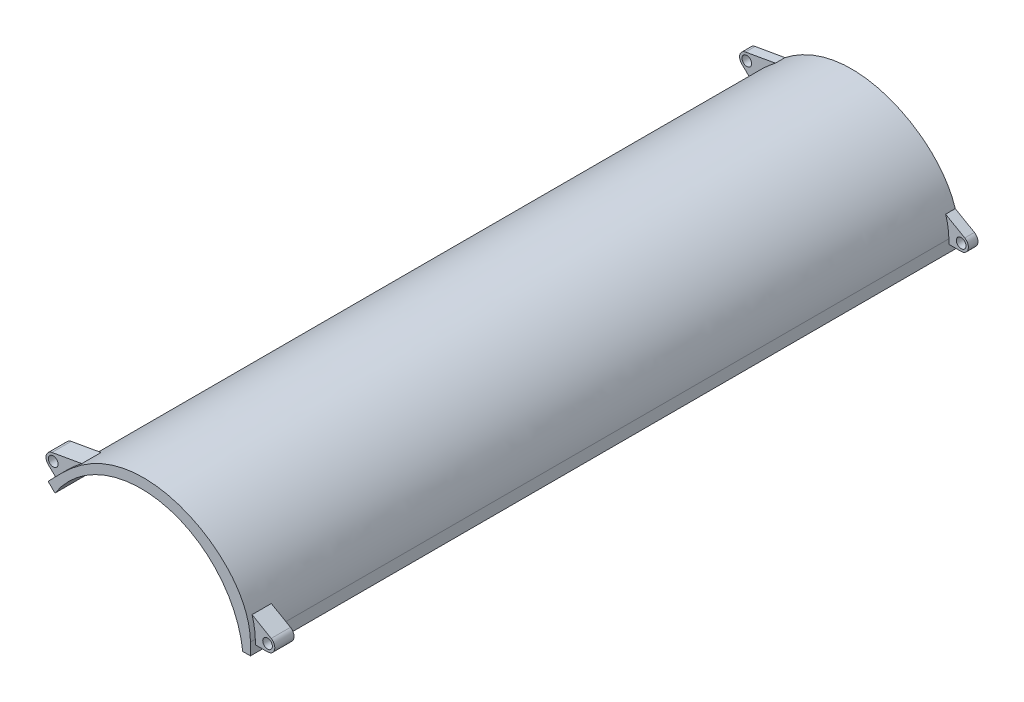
ISO-10303-21;
HEADER;
FILE_DESCRIPTION(('STEP AP214'),'2;1');
FILE_NAME('part.step','',(''),(''),'','','');
FILE_SCHEMA(('AUTOMOTIVE_DESIGN { 1 0 10303 214 1 1 1 1 }'));
ENDSEC;
DATA;
#1=APPLICATION_CONTEXT('core data for automotive mechanical design processes');
#2=APPLICATION_PROTOCOL_DEFINITION('international standard','automotive_design',2000,#1);
#3=PRODUCT_CONTEXT('',#1,'mechanical');
#4=PRODUCT('Part','Part','',(#3));
#5=PRODUCT_RELATED_PRODUCT_CATEGORY('part','',(#4));
#6=PRODUCT_DEFINITION_FORMATION('','',#4);
#7=PRODUCT_DEFINITION_CONTEXT('part definition',#1,'design');
#8=PRODUCT_DEFINITION('design','',#6,#7);
#9=PRODUCT_DEFINITION_SHAPE('','',#8);
#10=(LENGTH_UNIT() NAMED_UNIT(*) SI_UNIT(.MILLI.,.METRE.));
#11=(NAMED_UNIT(*) PLANE_ANGLE_UNIT() SI_UNIT($,.RADIAN.));
#12=(NAMED_UNIT(*) SI_UNIT($,.STERADIAN.) SOLID_ANGLE_UNIT());
#13=UNCERTAINTY_MEASURE_WITH_UNIT(LENGTH_MEASURE(1.E-05),#10,'distance_accuracy_value','');
#14=(GEOMETRIC_REPRESENTATION_CONTEXT(3) GLOBAL_UNCERTAINTY_ASSIGNED_CONTEXT((#13)) GLOBAL_UNIT_ASSIGNED_CONTEXT((#10,
#11,#12)) REPRESENTATION_CONTEXT('',''));
#15=CARTESIAN_POINT('',(0.,0.,0.));
#16=DIRECTION('',(0.,0.,1.));
#17=DIRECTION('',(1.,0.,0.));
#18=AXIS2_PLACEMENT_3D('',#15,#16,#17);
#19=CARTESIAN_POINT('',(479.524287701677,50.,735.));
#20=CARTESIAN_POINT('',(477.15378099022,170.567422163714,735.));
#21=CARTESIAN_POINT('',(359.356081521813,236.563554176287,735.));
#22=CARTESIAN_POINT('',(287.408844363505,253.328836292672,735.));
#23=CARTESIAN_POINT('',(219.133886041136,251.435560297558,735.));
#24=CARTESIAN_POINT('',(152.416815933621,225.58654086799,735.));
#25=CARTESIAN_POINT('',(108.187547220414,179.583185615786,735.));
#26=CARTESIAN_POINT('',(69.7200278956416,139.572690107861,735.));
#27=B_SPLINE_CURVE_WITH_KNOTS('',7,(#19,#20,#21,#22,#23,#24,#25,#26),.UNSPECIFIED.,.F.,.F.,(8,
8),(0.,1.),.UNSPECIFIED.);
#28=DIRECTION('',(0.,0.,-1.));
#29=VECTOR('',#28,1.);
#30=SURFACE_OF_LINEAR_EXTRUSION('',#27,#29);
#31=CARTESIAN_POINT('',(69.7200278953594,139.572690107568,685.));
#32=CARTESIAN_POINT('',(76.0741492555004,146.181682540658,685.));
#33=CARTESIAN_POINT('',(82.5854794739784,152.954189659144,685.));
#34=CARTESIAN_POINT('',(89.3294022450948,159.772367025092,685.));
#35=CARTESIAN_POINT('',(96.3532676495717,166.535005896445,685.));
#36=CARTESIAN_POINT('',(103.683856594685,173.1559041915,685.));
#37=CARTESIAN_POINT('',(111.333957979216,179.561593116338,685.));
#38=CARTESIAN_POINT('',(119.307330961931,185.688881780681,685.));
#39=B_SPLINE_CURVE_WITH_KNOTS('',7,(#31,#32,#33,#34,#35,#36,#37,#38),.UNSPECIFIED.,.F.,.F.,(8,
8),(0.,0.165181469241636),.UNSPECIFIED.);
#40=CARTESIAN_POINT('',(69.7200278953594,139.572690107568,685.));
#41=VERTEX_POINT('',#40);
#42=CARTESIAN_POINT('',(119.307330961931,185.688881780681,685.));
#43=VERTEX_POINT('',#42);
#44=EDGE_CURVE('E224',#41,#43,#39,.T.);
#45=ORIENTED_EDGE('',*,*,#44,.T.);
#46=DIRECTION('',(0.,0.,1.));
#47=VECTOR('',#46,1.);
#48=CARTESIAN_POINT('',(119.307330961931,185.688881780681,685.));
#49=LINE('',#48,#47);
#50=CARTESIAN_POINT('',(119.307330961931,185.688881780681,725.));
#51=VERTEX_POINT('',#50);
#52=EDGE_CURVE('E207',#43,#51,#49,.T.);
#53=ORIENTED_EDGE('',*,*,#52,.T.);
#54=CARTESIAN_POINT('',(69.7200278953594,139.572690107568,725.));
#55=CARTESIAN_POINT('',(76.0741492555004,146.181682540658,725.));
#56=CARTESIAN_POINT('',(82.5854794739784,152.954189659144,725.));
#57=CARTESIAN_POINT('',(89.3294022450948,159.772367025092,725.));
#58=CARTESIAN_POINT('',(96.3532676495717,166.535005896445,725.));
#59=CARTESIAN_POINT('',(103.683856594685,173.1559041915,725.));
#60=CARTESIAN_POINT('',(111.333957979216,179.561593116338,725.));
#61=CARTESIAN_POINT('',(119.307330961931,185.688881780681,725.));
#62=B_SPLINE_CURVE_WITH_KNOTS('',7,(#54,#55,#56,#57,#58,#59,#60,#61),.UNSPECIFIED.,.F.,.F.,(8,
8),(0.,0.165181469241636),.UNSPECIFIED.);
#63=CARTESIAN_POINT('',(69.7200278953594,139.572690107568,725.));
#64=VERTEX_POINT('',#63);
#65=EDGE_CURVE('E248',#64,#51,#62,.T.);
#66=ORIENTED_EDGE('',*,*,#65,.F.);
#67=DIRECTION('',(0.,0.,-1.));
#68=VECTOR('',#67,1.);
#69=CARTESIAN_POINT('',(69.7200278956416,139.572690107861,735.));
#70=LINE('',#69,#68);
#71=CARTESIAN_POINT('',(69.7200278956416,139.572690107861,735.));
#72=VERTEX_POINT('',#71);
#73=EDGE_CURVE('E461',#72,#64,#70,.T.);
#74=ORIENTED_EDGE('',*,*,#73,.F.);
#75=CARTESIAN_POINT('',(479.524287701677,50.,735.));
#76=VERTEX_POINT('',#75);
#77=EDGE_CURVE('E388',#76,#72,#27,.T.);
#78=ORIENTED_EDGE('',*,*,#77,.F.);
#79=DIRECTION('',(0.,0.,-1.));
#80=VECTOR('',#79,1.);
#81=CARTESIAN_POINT('',(479.524287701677,50.,735.));
#82=LINE('',#81,#80);
#83=CARTESIAN_POINT('',(479.524287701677,50.0000000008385,725.));
#84=VERTEX_POINT('',#83);
#85=EDGE_CURVE('E430',#76,#84,#82,.T.);
#86=ORIENTED_EDGE('',*,*,#85,.T.);
#87=CARTESIAN_POINT('',(472.826933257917,90.8956368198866,725.));
#88=CARTESIAN_POINT('',(474.517057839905,85.4877859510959,725.));
#89=CARTESIAN_POINT('',(475.993797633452,79.9371958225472,725.));
#90=CARTESIAN_POINT('',(477.239796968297,74.2424995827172,725.));
#91=CARTESIAN_POINT('',(478.236465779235,68.4024521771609,725.));
#92=CARTESIAN_POINT('',(478.963896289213,62.4159497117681,725.));
#93=CARTESIAN_POINT('',(479.40077470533,56.2820507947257,725.));
#94=CARTESIAN_POINT('',(479.524287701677,50.0000000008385,725.));
#95=B_SPLINE_CURVE_WITH_KNOTS('',7,(#87,#88,#89,#90,#91,#92,#93,#94),.UNSPECIFIED.,.F.,.F.,(8,
8),(0.94789595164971,1.),.UNSPECIFIED.);
#96=CARTESIAN_POINT('',(472.82693326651,90.8956367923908,725.));
#97=VERTEX_POINT('',#96);
#98=EDGE_CURVE('E269',#97,#84,#95,.T.);
#99=ORIENTED_EDGE('',*,*,#98,.F.);
#100=DIRECTION('',(0.,0.,1.));
#101=VECTOR('',#100,1.);
#102=CARTESIAN_POINT('',(472.826933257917,90.8956368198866,685.));
#103=LINE('',#102,#101);
#104=CARTESIAN_POINT('',(472.826933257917,90.8956368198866,685.));
#105=VERTEX_POINT('',#104);
#106=EDGE_CURVE('E308',#105,#97,#103,.T.);
#107=ORIENTED_EDGE('',*,*,#106,.F.);
#108=CARTESIAN_POINT('',(472.826933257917,90.8956368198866,685.));
#109=CARTESIAN_POINT('',(474.517057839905,85.4877859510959,685.));
#110=CARTESIAN_POINT('',(475.993797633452,79.9371958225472,685.));
#111=CARTESIAN_POINT('',(477.239796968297,74.2424995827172,685.));
#112=CARTESIAN_POINT('',(478.236465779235,68.4024521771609,685.));
#113=CARTESIAN_POINT('',(478.963896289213,62.4159497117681,685.));
#114=CARTESIAN_POINT('',(479.40077470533,56.2820507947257,685.));
#115=CARTESIAN_POINT('',(479.524287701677,50.0000000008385,685.));
#116=B_SPLINE_CURVE_WITH_KNOTS('',7,(#108,#109,#110,#111,#112,#113,#114,#115),.UNSPECIFIED.,.F.,
.F.,(8,8),(0.94789595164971,1.),.UNSPECIFIED.);
#117=CARTESIAN_POINT('',(479.524287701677,50.0000000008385,685.));
#118=VERTEX_POINT('',#117);
#119=EDGE_CURVE('E272',#105,#118,#116,.T.);
#120=ORIENTED_EDGE('',*,*,#119,.T.);
#121=CARTESIAN_POINT('',(479.524287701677,50.,-715.));
#122=VERTEX_POINT('',#121);
#123=EDGE_CURVE('E454',#118,#122,#82,.T.);
#124=ORIENTED_EDGE('',*,*,#123,.T.);
#125=CARTESIAN_POINT('',(472.826933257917,90.8956368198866,-715.));
#126=CARTESIAN_POINT('',(474.517057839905,85.4877859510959,-715.));
#127=CARTESIAN_POINT('',(475.993797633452,79.9371958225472,-715.));
#128=CARTESIAN_POINT('',(477.239796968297,74.2424995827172,-715.));
#129=CARTESIAN_POINT('',(478.236465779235,68.4024521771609,-715.));
#130=CARTESIAN_POINT('',(478.963896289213,62.4159497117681,-715.));
#131=CARTESIAN_POINT('',(479.40077470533,56.2820507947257,-715.));
#132=CARTESIAN_POINT('',(479.524287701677,50.0000000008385,-715.));
#133=B_SPLINE_CURVE_WITH_KNOTS('',7,(#125,#126,#127,#128,#129,#130,#131,#132),.UNSPECIFIED.,.F.,
.F.,(8,8),(0.,1.),.UNSPECIFIED.);
#134=CARTESIAN_POINT('',(472.82693326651,90.8956367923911,-715.));
#135=VERTEX_POINT('',#134);
#136=EDGE_CURVE('E487',#135,#122,#133,.T.);
#137=ORIENTED_EDGE('',*,*,#136,.F.);
#138=DIRECTION('',(0.,0.,-1.));
#139=VECTOR('',#138,1.);
#140=CARTESIAN_POINT('',(472.826933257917,90.8956368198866,-715.));
#141=LINE('',#140,#139);
#142=CARTESIAN_POINT('',(472.826933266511,90.8956367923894,-735.));
#143=VERTEX_POINT('',#142);
#144=EDGE_CURVE('E365',#135,#143,#141,.T.);
#145=ORIENTED_EDGE('',*,*,#144,.T.);
#146=CARTESIAN_POINT('',(479.524287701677,50.,-735.));
#147=CARTESIAN_POINT('',(477.15378099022,170.567422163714,-735.));
#148=CARTESIAN_POINT('',(359.356081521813,236.563554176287,-735.));
#149=CARTESIAN_POINT('',(287.408844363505,253.328836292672,-735.));
#150=CARTESIAN_POINT('',(219.133886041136,251.435560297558,-735.));
#151=CARTESIAN_POINT('',(152.416815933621,225.58654086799,-735.));
#152=CARTESIAN_POINT('',(108.187547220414,179.583185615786,-735.));
#153=CARTESIAN_POINT('',(69.7200278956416,139.572690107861,-735.));
#154=B_SPLINE_CURVE_WITH_KNOTS('',7,(#146,#147,#148,#149,#150,#151,#152,#153),.UNSPECIFIED.,.F.,
.F.,(8,8),(0.,1.),.UNSPECIFIED.);
#155=CARTESIAN_POINT('',(119.307330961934,185.688881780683,-735.));
#156=VERTEX_POINT('',#155);
#157=EDGE_CURVE('E436',#143,#156,#154,.T.);
#158=ORIENTED_EDGE('',*,*,#157,.T.);
#159=DIRECTION('',(0.,0.,-1.));
#160=VECTOR('',#159,1.);
#161=CARTESIAN_POINT('',(119.307330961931,185.688881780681,-715.));
#162=LINE('',#161,#160);
#163=CARTESIAN_POINT('',(119.307330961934,185.688881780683,-715.));
#164=VERTEX_POINT('',#163);
#165=EDGE_CURVE('E310',#164,#156,#162,.T.);
#166=ORIENTED_EDGE('',*,*,#165,.F.);
#167=CARTESIAN_POINT('',(69.7200278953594,139.572690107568,-715.));
#168=CARTESIAN_POINT('',(76.0741492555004,146.181682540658,-715.));
#169=CARTESIAN_POINT('',(82.5854794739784,152.954189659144,-715.));
#170=CARTESIAN_POINT('',(89.3294022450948,159.772367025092,-715.));
#171=CARTESIAN_POINT('',(96.3532676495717,166.535005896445,-715.));
#172=CARTESIAN_POINT('',(103.683856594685,173.1559041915,-715.));
#173=CARTESIAN_POINT('',(111.333957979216,179.561593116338,-715.));
#174=CARTESIAN_POINT('',(119.307330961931,185.688881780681,-715.));
#175=B_SPLINE_CURVE_WITH_KNOTS('',7,(#167,#168,#169,#170,#171,#172,#173,#174),.UNSPECIFIED.,.F.,
.F.,(8,8),(0.,1.),.UNSPECIFIED.);
#176=CARTESIAN_POINT('',(69.7200278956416,139.572690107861,-715.));
#177=VERTEX_POINT('',#176);
#178=EDGE_CURVE('E320',#177,#164,#175,.T.);
#179=ORIENTED_EDGE('',*,*,#178,.F.);
#180=EDGE_CURVE('E45',#41,#177,#70,.T.);
#181=ORIENTED_EDGE('',*,*,#180,.F.);
#182=EDGE_LOOP('',(#45,#53,#66,#74,#78,#86,#99,#107,#120,#124,#137,#145,#158,#166,#179,#181));
#183=FACE_BOUND('',#182,.T.);
#184=ADVANCED_FACE('F41',(#183),#30,.F.);
#185=CARTESIAN_POINT('',(59.3239744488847,128.759639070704,735.));
#186=DIRECTION('',(0.720870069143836,-0.693070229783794,0.));
#187=DIRECTION('',(0.693070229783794,0.720870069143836,0.));
#188=AXIS2_PLACEMENT_3D('',#185,#186,#187);
#189=PLANE('',#188);
#190=DIRECTION('',(0.693070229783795,0.720870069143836,0.));
#191=VECTOR('',#190,1.);
#192=CARTESIAN_POINT('',(64.8607561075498,134.51850737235,685.));
#193=LINE('',#192,#191);
#194=CARTESIAN_POINT('',(64.8607561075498,134.51850737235,685.));
#195=VERTEX_POINT('',#194);
#196=EDGE_CURVE('E218',#195,#41,#193,.T.);
#197=ORIENTED_EDGE('',*,*,#196,.T.);
#198=ORIENTED_EDGE('',*,*,#180,.T.);
#199=DIRECTION('',(-0.693070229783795,-0.720870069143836,0.));
#200=VECTOR('',#199,1.);
#201=CARTESIAN_POINT('',(87.7853071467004,158.362588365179,-715.));
#202=LINE('',#201,#200);
#203=CARTESIAN_POINT('',(64.8607561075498,134.51850737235,-715.));
#204=VERTEX_POINT('',#203);
#205=EDGE_CURVE('E342',#177,#204,#202,.T.);
#206=ORIENTED_EDGE('',*,*,#205,.T.);
#207=DIRECTION('',(0.,0.,-1.));
#208=VECTOR('',#207,1.);
#209=CARTESIAN_POINT('',(64.8607561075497,134.51850737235,-715.));
#210=LINE('',#209,#208);
#211=CARTESIAN_POINT('',(64.8607561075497,134.51850737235,-735.));
#212=VERTEX_POINT('',#211);
#213=EDGE_CURVE('E317',#204,#212,#210,.T.);
#214=ORIENTED_EDGE('',*,*,#213,.T.);
#215=DIRECTION('',(-0.693070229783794,-0.720870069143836,0.));
#216=VECTOR('',#215,1.);
#217=CARTESIAN_POINT('',(59.3239744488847,128.759639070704,-735.));
#218=LINE('',#217,#216);
#219=CARTESIAN_POINT('',(59.3239744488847,128.759639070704,-735.));
#220=VERTEX_POINT('',#219);
#221=EDGE_CURVE('E438',#212,#220,#218,.T.);
#222=ORIENTED_EDGE('',*,*,#221,.T.);
#223=DIRECTION('',(0.,0.,-1.));
#224=VECTOR('',#223,1.);
#225=CARTESIAN_POINT('',(59.3239744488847,128.759639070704,735.));
#226=LINE('',#225,#224);
#227=CARTESIAN_POINT('',(59.3239744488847,128.759639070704,735.));
#228=VERTEX_POINT('',#227);
#229=EDGE_CURVE('E540',#228,#220,#226,.T.);
#230=ORIENTED_EDGE('',*,*,#229,.F.);
#231=DIRECTION('',(-0.693070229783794,-0.720870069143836,0.));
#232=VECTOR('',#231,1.);
#233=CARTESIAN_POINT('',(59.3239744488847,128.759639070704,735.));
#234=LINE('',#233,#232);
#235=EDGE_CURVE('E393',#72,#228,#234,.T.);
#236=ORIENTED_EDGE('',*,*,#235,.F.);
#237=ORIENTED_EDGE('',*,*,#73,.T.);
#238=DIRECTION('',(0.693070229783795,0.720870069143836,0.));
#239=VECTOR('',#238,1.);
#240=CARTESIAN_POINT('',(64.8607561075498,134.51850737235,725.));
#241=LINE('',#240,#239);
#242=CARTESIAN_POINT('',(64.8607561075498,134.51850737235,725.));
#243=VERTEX_POINT('',#242);
#244=EDGE_CURVE('E232',#243,#64,#241,.T.);
#245=ORIENTED_EDGE('',*,*,#244,.F.);
#246=DIRECTION('',(0.,0.,1.));
#247=VECTOR('',#246,1.);
#248=CARTESIAN_POINT('',(64.8607561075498,134.51850737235,685.));
#249=LINE('',#248,#247);
#250=EDGE_CURVE('E260',#195,#243,#249,.T.);
#251=ORIENTED_EDGE('',*,*,#250,.F.);
#252=EDGE_LOOP('',(#197,#198,#206,#214,#222,#230,#236,#237,#245,#251));
#253=FACE_BOUND('',#252,.T.);
#254=ADVANCED_FACE('F402',(#253),#189,.F.);
#255=CARTESIAN_POINT('',(479.524287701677,25.,735.));
#256=DIRECTION('',(-1.,0.,0.));
#257=DIRECTION('',(0.,-1.,0.));
#258=AXIS2_PLACEMENT_3D('',#255,#256,#257);
#259=PLANE('',#258);
#260=DIRECTION('',(0.,-1.,0.));
#261=VECTOR('',#260,1.);
#262=CARTESIAN_POINT('',(479.524287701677,50.0000000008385,685.));
#263=LINE('',#262,#261);
#264=CARTESIAN_POINT('',(479.524287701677,40.,685.));
#265=VERTEX_POINT('',#264);
#266=EDGE_CURVE('E277',#118,#265,#263,.T.);
#267=ORIENTED_EDGE('',*,*,#266,.T.);
#268=DIRECTION('',(0.,0.,1.));
#269=VECTOR('',#268,1.);
#270=CARTESIAN_POINT('',(479.524287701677,40.,685.));
#271=LINE('',#270,#269);
#272=CARTESIAN_POINT('',(479.524287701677,40.,725.));
#273=VERTEX_POINT('',#272);
#274=EDGE_CURVE('E292',#265,#273,#271,.T.);
#275=ORIENTED_EDGE('',*,*,#274,.T.);
#276=DIRECTION('',(0.,-1.,0.));
#277=VECTOR('',#276,1.);
#278=CARTESIAN_POINT('',(479.524287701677,50.0000000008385,725.));
#279=LINE('',#278,#277);
#280=EDGE_CURVE('E296',#84,#273,#279,.T.);
#281=ORIENTED_EDGE('',*,*,#280,.F.);
#282=ORIENTED_EDGE('',*,*,#85,.F.);
#283=DIRECTION('',(0.,1.,0.));
#284=VECTOR('',#283,1.);
#285=CARTESIAN_POINT('',(479.524287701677,25.,735.));
#286=LINE('',#285,#284);
#287=CARTESIAN_POINT('',(479.524287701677,25.,735.));
#288=VERTEX_POINT('',#287);
#289=EDGE_CURVE('E386',#288,#76,#286,.T.);
#290=ORIENTED_EDGE('',*,*,#289,.F.);
#291=DIRECTION('',(0.,0.,-1.));
#292=VECTOR('',#291,1.);
#293=CARTESIAN_POINT('',(479.524287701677,25.,735.));
#294=LINE('',#293,#292);
#295=CARTESIAN_POINT('',(479.524287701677,25.,-735.));
#296=VERTEX_POINT('',#295);
#297=EDGE_CURVE('E51',#288,#296,#294,.T.);
#298=ORIENTED_EDGE('',*,*,#297,.T.);
#299=DIRECTION('',(0.,1.,0.));
#300=VECTOR('',#299,1.);
#301=CARTESIAN_POINT('',(479.524287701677,25.,-735.));
#302=LINE('',#301,#300);
#303=CARTESIAN_POINT('',(479.524287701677,40.,-735.));
#304=VERTEX_POINT('',#303);
#305=EDGE_CURVE('E427',#296,#304,#302,.T.);
#306=ORIENTED_EDGE('',*,*,#305,.T.);
#307=DIRECTION('',(0.,0.,-1.));
#308=VECTOR('',#307,1.);
#309=CARTESIAN_POINT('',(479.524287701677,40.,-715.));
#310=LINE('',#309,#308);
#311=CARTESIAN_POINT('',(479.524287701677,40.,-715.));
#312=VERTEX_POINT('',#311);
#313=EDGE_CURVE('E376',#312,#304,#310,.T.);
#314=ORIENTED_EDGE('',*,*,#313,.F.);
#315=DIRECTION('',(0.,1.,0.));
#316=VECTOR('',#315,1.);
#317=CARTESIAN_POINT('',(479.524287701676,-1.107582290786E-12,-715.));
#318=LINE('',#317,#316);
#319=EDGE_CURVE('E359',#312,#122,#318,.T.);
#320=ORIENTED_EDGE('',*,*,#319,.T.);
#321=ORIENTED_EDGE('',*,*,#123,.F.);
#322=EDGE_LOOP('',(#267,#275,#281,#282,#290,#298,#306,#314,#320,#321));
#323=FACE_BOUND('',#322,.T.);
#324=ADVANCED_FACE('F404',(#323),#259,.F.);
#325=CARTESIAN_POINT('',(252.5,1.52655665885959E-13,735.));
#326=DIRECTION('',(0.,0.,-1.));
#327=DIRECTION('',(-1.,0.,0.));
#328=AXIS2_PLACEMENT_3D('',#325,#326,#327);
#329=CYLINDRICAL_SURFACE('',#328,212.5);
#330=CARTESIAN_POINT('',(252.5,1.52655665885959E-13,-735.));
#331=DIRECTION('',(0.,0.,-1.));
#332=DIRECTION('',(-1.,0.,0.));
#333=AXIS2_PLACEMENT_3D('',#330,#331,#332);
#334=CIRCLE('',#333,212.5);
#335=CARTESIAN_POINT('',(73.7413758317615,114.898234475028,-735.));
#336=VERTEX_POINT('',#335);
#337=CARTESIAN_POINT('',(463.524287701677,25.,-735.));
#338=VERTEX_POINT('',#337);
#339=EDGE_CURVE('E379',#336,#338,#334,.T.);
#340=ORIENTED_EDGE('',*,*,#339,.T.);
#341=DIRECTION('',(0.,0.,-1.));
#342=VECTOR('',#341,1.);
#343=CARTESIAN_POINT('',(463.524287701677,25.,735.));
#344=LINE('',#343,#342);
#345=CARTESIAN_POINT('',(463.524287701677,25.,735.));
#346=VERTEX_POINT('',#345);
#347=EDGE_CURVE('E11',#346,#338,#344,.T.);
#348=ORIENTED_EDGE('',*,*,#347,.F.);
#349=CARTESIAN_POINT('',(252.5,1.52655665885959E-13,735.));
#350=DIRECTION('',(0.,0.,-1.));
#351=DIRECTION('',(-1.,0.,0.));
#352=AXIS2_PLACEMENT_3D('',#349,#350,#351);
#353=CIRCLE('',#352,212.5);
#354=CARTESIAN_POINT('',(73.7413758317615,114.898234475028,735.));
#355=VERTEX_POINT('',#354);
#356=EDGE_CURVE('E380',#355,#346,#353,.T.);
#357=ORIENTED_EDGE('',*,*,#356,.F.);
#358=DIRECTION('',(0.,0.,-1.));
#359=VECTOR('',#358,1.);
#360=CARTESIAN_POINT('',(73.7413758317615,114.898234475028,735.));
#361=LINE('',#360,#359);
#362=EDGE_CURVE('E539',#355,#336,#361,.T.);
#363=ORIENTED_EDGE('',*,*,#362,.T.);
#364=EDGE_LOOP('',(#340,#348,#357,#363));
#365=FACE_BOUND('',#364,.T.);
#366=ADVANCED_FACE('F43',(#365),#329,.F.);
#367=CARTESIAN_POINT('',(463.524287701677,25.,735.));
#368=DIRECTION('',(0.,1.,0.));
#369=DIRECTION('',(0.,0.,1.));
#370=AXIS2_PLACEMENT_3D('',#367,#368,#369);
#371=PLANE('',#370);
#372=DIRECTION('',(1.,0.,0.));
#373=VECTOR('',#372,1.);
#374=CARTESIAN_POINT('',(463.524287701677,25.,-735.));
#375=LINE('',#374,#373);
#376=EDGE_CURVE('E419',#338,#296,#375,.T.);
#377=ORIENTED_EDGE('',*,*,#376,.T.);
#378=ORIENTED_EDGE('',*,*,#297,.F.);
#379=DIRECTION('',(1.,0.,0.));
#380=VECTOR('',#379,1.);
#381=CARTESIAN_POINT('',(463.524287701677,25.,735.));
#382=LINE('',#381,#380);
#383=EDGE_CURVE('E383',#346,#288,#382,.T.);
#384=ORIENTED_EDGE('',*,*,#383,.F.);
#385=ORIENTED_EDGE('',*,*,#347,.T.);
#386=EDGE_LOOP('',(#377,#378,#384,#385));
#387=FACE_BOUND('',#386,.T.);
#388=ADVANCED_FACE('F407',(#387),#371,.F.);
#389=CARTESIAN_POINT('',(59.3239744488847,128.759639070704,735.));
#390=DIRECTION('',(0.693070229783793,0.720870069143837,0.));
#391=DIRECTION('',(-0.720870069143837,0.693070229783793,0.));
#392=AXIS2_PLACEMENT_3D('',#389,#390,#391);
#393=PLANE('',#392);
#394=DIRECTION('',(0.720870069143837,-0.693070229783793,0.));
#395=VECTOR('',#394,1.);
#396=CARTESIAN_POINT('',(59.3239744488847,128.759639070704,-735.));
#397=LINE('',#396,#395);
#398=EDGE_CURVE('E384',#220,#336,#397,.T.);
#399=ORIENTED_EDGE('',*,*,#398,.T.);
#400=ORIENTED_EDGE('',*,*,#362,.F.);
#401=DIRECTION('',(0.720870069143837,-0.693070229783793,0.));
#402=VECTOR('',#401,1.);
#403=CARTESIAN_POINT('',(59.3239744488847,128.759639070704,735.));
#404=LINE('',#403,#402);
#405=EDGE_CURVE('E541',#228,#355,#404,.T.);
#406=ORIENTED_EDGE('',*,*,#405,.F.);
#407=ORIENTED_EDGE('',*,*,#229,.T.);
#408=EDGE_LOOP('',(#399,#400,#406,#407));
#409=FACE_BOUND('',#408,.T.);
#410=ADVANCED_FACE('F409',(#409),#393,.F.);
#411=CARTESIAN_POINT('',(252.5,1.52655665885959E-13,735.));
#412=DIRECTION('',(0.,0.,-1.));
#413=DIRECTION('',(-1.,0.,0.));
#414=AXIS2_PLACEMENT_3D('',#411,#412,#413);
#415=PLANE('',#414);
#416=ORIENTED_EDGE('',*,*,#356,.T.);
#417=ORIENTED_EDGE('',*,*,#383,.T.);
#418=ORIENTED_EDGE('',*,*,#289,.T.);
#419=ORIENTED_EDGE('',*,*,#77,.T.);
#420=ORIENTED_EDGE('',*,*,#235,.T.);
#421=ORIENTED_EDGE('',*,*,#405,.T.);
#422=EDGE_LOOP('',(#416,#417,#418,#419,#420,#421));
#423=FACE_BOUND('',#422,.T.);
#424=ADVANCED_FACE('F415',(#423),#415,.F.);
#425=CARTESIAN_POINT('',(252.5,1.52655665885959E-13,-735.));
#426=DIRECTION('',(0.,0.,-1.));
#427=DIRECTION('',(-1.,0.,0.));
#428=AXIS2_PLACEMENT_3D('',#425,#426,#427);
#429=PLANE('',#428);
#430=DIRECTION('',(0.984807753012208,0.173648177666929,0.));
#431=VECTOR('',#430,1.);
#432=CARTESIAN_POINT('',(216.729080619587,202.866964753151,-735.));
#433=LINE('',#432,#431);
#434=CARTESIAN_POINT('',(57.3952773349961,174.772116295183,-735.));
#435=VERTEX_POINT('',#434);
#436=EDGE_CURVE('E329',#435,#156,#433,.T.);
#437=ORIENTED_EDGE('',*,*,#436,.T.);
#438=ORIENTED_EDGE('',*,*,#157,.F.);
#439=DIRECTION('',(0.866025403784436,-0.500000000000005,0.));
#440=VECTOR('',#439,1.);
#441=CARTESIAN_POINT('',(346.940698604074,163.576088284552,-735.));
#442=LINE('',#441,#440);
#443=CARTESIAN_POINT('',(512.5,67.9903810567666,-735.));
#444=VERTEX_POINT('',#443);
#445=EDGE_CURVE('E371',#143,#444,#442,.T.);
#446=ORIENTED_EDGE('',*,*,#445,.T.);
#447=CARTESIAN_POINT('',(505.,55.,-735.));
#448=DIRECTION('',(0.,0.,-1.));
#449=DIRECTION('',(-1.,0.,0.));
#450=AXIS2_PLACEMENT_3D('',#447,#448,#449);
#451=CIRCLE('',#450,15.);
#452=CARTESIAN_POINT('',(505.,40.,-735.));
#453=VERTEX_POINT('',#452);
#454=EDGE_CURVE('E368',#444,#453,#451,.T.);
#455=ORIENTED_EDGE('',*,*,#454,.T.);
#456=DIRECTION('',(-1.,0.,0.));
#457=VECTOR('',#456,1.);
#458=CARTESIAN_POINT('',(252.5,40.,-735.));
#459=LINE('',#458,#457);
#460=EDGE_CURVE('E352',#453,#304,#459,.T.);
#461=ORIENTED_EDGE('',*,*,#460,.T.);
#462=ORIENTED_EDGE('',*,*,#305,.F.);
#463=ORIENTED_EDGE('',*,*,#376,.F.);
#464=ORIENTED_EDGE('',*,*,#339,.F.);
#465=ORIENTED_EDGE('',*,*,#398,.F.);
#466=ORIENTED_EDGE('',*,*,#221,.F.);
#467=DIRECTION('',(-0.720870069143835,0.693070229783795,0.));
#468=VECTOR('',#467,1.);
#469=CARTESIAN_POINT('',(229.575448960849,-23.8440809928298,-735.));
#470=LINE('',#469,#468);
#471=CARTESIAN_POINT('',(49.6039465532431,149.186948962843,-735.));
#472=VERTEX_POINT('',#471);
#473=EDGE_CURVE('E328',#212,#472,#470,.T.);
#474=ORIENTED_EDGE('',*,*,#473,.T.);
#475=CARTESIAN_POINT('',(60.0000000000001,160.,-735.));
#476=DIRECTION('',(0.,0.,-1.));
#477=DIRECTION('',(-1.,0.,0.));
#478=AXIS2_PLACEMENT_3D('',#475,#476,#477);
#479=CIRCLE('',#478,15.);
#480=EDGE_CURVE('E325',#472,#435,#479,.T.);
#481=ORIENTED_EDGE('',*,*,#480,.T.);
#482=EDGE_LOOP('',(#437,#438,#446,#455,#461,#462,#463,#464,#465,#466,#474,#481));
#483=FACE_BOUND('',#482,.T.);
#484=CARTESIAN_POINT('',(505.,55.,-735.));
#485=DIRECTION('',(0.,0.,-1.));
#486=DIRECTION('',(-1.,0.,0.));
#487=AXIS2_PLACEMENT_3D('',#484,#485,#486);
#488=CIRCLE('',#487,9.99999999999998);
#489=CARTESIAN_POINT('',(495.,55.,-735.));
#490=VERTEX_POINT('',#489);
#491=EDGE_CURVE('E346',#490,#490,#488,.T.);
#492=ORIENTED_EDGE('',*,*,#491,.F.);
#493=EDGE_LOOP('',(#492));
#494=FACE_BOUND('',#493,.T.);
#495=CARTESIAN_POINT('',(60.0000000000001,160.,-735.));
#496=DIRECTION('',(0.,0.,-1.));
#497=DIRECTION('',(-1.,0.,0.));
#498=AXIS2_PLACEMENT_3D('',#495,#496,#497);
#499=CIRCLE('',#498,9.99999999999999);
#500=CARTESIAN_POINT('',(50.0000000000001,160.,-735.));
#501=VERTEX_POINT('',#500);
#502=EDGE_CURVE('E343',#501,#501,#499,.T.);
#503=ORIENTED_EDGE('',*,*,#502,.F.);
#504=EDGE_LOOP('',(#503));
#505=FACE_BOUND('',#504,.T.);
#506=ADVANCED_FACE('F433',(#483,#494,#505),#429,.T.);
#507=CARTESIAN_POINT('',(252.5,40.,-715.));
#508=DIRECTION('',(0.,-1.,0.));
#509=DIRECTION('',(0.,0.,-1.));
#510=AXIS2_PLACEMENT_3D('',#507,#508,#509);
#511=PLANE('',#510);
#512=ORIENTED_EDGE('',*,*,#460,.F.);
#513=DIRECTION('',(0.,0.,-1.));
#514=VECTOR('',#513,1.);
#515=CARTESIAN_POINT('',(505.,40.,-715.));
#516=LINE('',#515,#514);
#517=CARTESIAN_POINT('',(505.,40.,-715.));
#518=VERTEX_POINT('',#517);
#519=EDGE_CURVE('E374',#518,#453,#516,.T.);
#520=ORIENTED_EDGE('',*,*,#519,.F.);
#521=DIRECTION('',(-1.,0.,0.));
#522=VECTOR('',#521,1.);
#523=CARTESIAN_POINT('',(252.5,40.,-715.));
#524=LINE('',#523,#522);
#525=EDGE_CURVE('E355',#518,#312,#524,.T.);
#526=ORIENTED_EDGE('',*,*,#525,.T.);
#527=ORIENTED_EDGE('',*,*,#313,.T.);
#528=EDGE_LOOP('',(#512,#520,#526,#527));
#529=FACE_BOUND('',#528,.T.);
#530=ADVANCED_FACE('F509',(#529),#511,.T.);
#531=CARTESIAN_POINT('',(505.,55.,-715.));
#532=DIRECTION('',(0.,0.,-1.));
#533=DIRECTION('',(-1.,0.,0.));
#534=AXIS2_PLACEMENT_3D('',#531,#532,#533);
#535=CYLINDRICAL_SURFACE('',#534,15.);
#536=ORIENTED_EDGE('',*,*,#454,.F.);
#537=DIRECTION('',(0.,0.,-1.));
#538=VECTOR('',#537,1.);
#539=CARTESIAN_POINT('',(512.5,67.9903810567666,-715.));
#540=LINE('',#539,#538);
#541=CARTESIAN_POINT('',(512.5,67.9903810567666,-715.));
#542=VERTEX_POINT('',#541);
#543=EDGE_CURVE('E372',#542,#444,#540,.T.);
#544=ORIENTED_EDGE('',*,*,#543,.F.);
#545=CARTESIAN_POINT('',(505.,55.,-715.));
#546=DIRECTION('',(0.,0.,-1.));
#547=DIRECTION('',(-1.,0.,0.));
#548=AXIS2_PLACEMENT_3D('',#545,#546,#547);
#549=CIRCLE('',#548,15.);
#550=EDGE_CURVE('E358',#542,#518,#549,.T.);
#551=ORIENTED_EDGE('',*,*,#550,.T.);
#552=ORIENTED_EDGE('',*,*,#519,.T.);
#553=EDGE_LOOP('',(#536,#544,#551,#552));
#554=FACE_BOUND('',#553,.T.);
#555=ADVANCED_FACE('F512',(#554),#535,.T.);
#556=CARTESIAN_POINT('',(346.940698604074,163.576088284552,-715.));
#557=DIRECTION('',(0.500000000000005,0.866025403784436,0.));
#558=DIRECTION('',(-0.866025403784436,0.500000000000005,0.));
#559=AXIS2_PLACEMENT_3D('',#556,#557,#558);
#560=PLANE('',#559);
#561=ORIENTED_EDGE('',*,*,#445,.F.);
#562=ORIENTED_EDGE('',*,*,#144,.F.);
#563=DIRECTION('',(0.866025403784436,-0.500000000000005,0.));
#564=VECTOR('',#563,1.);
#565=CARTESIAN_POINT('',(346.940698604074,163.576088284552,-715.));
#566=LINE('',#565,#564);
#567=EDGE_CURVE('E362',#135,#542,#566,.T.);
#568=ORIENTED_EDGE('',*,*,#567,.T.);
#569=ORIENTED_EDGE('',*,*,#543,.T.);
#570=EDGE_LOOP('',(#561,#562,#568,#569));
#571=FACE_BOUND('',#570,.T.);
#572=ADVANCED_FACE('F516',(#571),#560,.T.);
#573=CARTESIAN_POINT('',(477.54341263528,71.2130770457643,-715.));
#574=DIRECTION('',(0.,0.,1.));
#575=DIRECTION('',(1.,0.,0.));
#576=AXIS2_PLACEMENT_3D('',#573,#574,#575);
#577=PLANE('',#576);
#578=CARTESIAN_POINT('',(505.,55.,-715.));
#579=DIRECTION('',(0.,0.,-1.));
#580=DIRECTION('',(-1.,0.,0.));
#581=AXIS2_PLACEMENT_3D('',#578,#579,#580);
#582=CIRCLE('',#581,9.99999999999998);
#583=CARTESIAN_POINT('',(495.,55.,-715.));
#584=VERTEX_POINT('',#583);
#585=EDGE_CURVE('E349',#584,#584,#582,.T.);
#586=ORIENTED_EDGE('',*,*,#585,.T.);
#587=EDGE_LOOP('',(#586));
#588=FACE_BOUND('',#587,.T.);
#589=ORIENTED_EDGE('',*,*,#136,.T.);
#590=ORIENTED_EDGE('',*,*,#319,.F.);
#591=ORIENTED_EDGE('',*,*,#525,.F.);
#592=ORIENTED_EDGE('',*,*,#550,.F.);
#593=ORIENTED_EDGE('',*,*,#567,.F.);
#594=EDGE_LOOP('',(#589,#590,#591,#592,#593));
#595=FACE_BOUND('',#594,.T.);
#596=ADVANCED_FACE('F506',(#588,#595),#577,.T.);
#597=CARTESIAN_POINT('',(505.,55.,-715.));
#598=DIRECTION('',(0.,0.,-1.));
#599=DIRECTION('',(-1.,0.,0.));
#600=AXIS2_PLACEMENT_3D('',#597,#598,#599);
#601=CYLINDRICAL_SURFACE('',#600,9.99999999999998);
#602=ORIENTED_EDGE('',*,*,#585,.F.);
#603=EDGE_LOOP('',(#602));
#604=FACE_BOUND('',#603,.T.);
#605=ORIENTED_EDGE('',*,*,#491,.T.);
#606=EDGE_LOOP('',(#605));
#607=FACE_BOUND('',#606,.T.);
#608=ADVANCED_FACE('F601',(#604,#607),#601,.F.);
#609=CARTESIAN_POINT('',(216.729080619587,202.866964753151,-715.));
#610=DIRECTION('',(-0.173648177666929,0.984807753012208,0.));
#611=DIRECTION('',(-0.984807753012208,-0.173648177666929,0.));
#612=AXIS2_PLACEMENT_3D('',#609,#610,#611);
#613=PLANE('',#612);
#614=ORIENTED_EDGE('',*,*,#436,.F.);
#615=DIRECTION('',(0.,0.,-1.));
#616=VECTOR('',#615,1.);
#617=CARTESIAN_POINT('',(57.3952773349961,174.772116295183,-715.));
#618=LINE('',#617,#616);
#619=CARTESIAN_POINT('',(57.3952773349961,174.772116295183,-715.));
#620=VERTEX_POINT('',#619);
#621=EDGE_CURVE('E323',#620,#435,#618,.T.);
#622=ORIENTED_EDGE('',*,*,#621,.F.);
#623=DIRECTION('',(0.984807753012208,0.173648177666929,0.));
#624=VECTOR('',#623,1.);
#625=CARTESIAN_POINT('',(216.729080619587,202.866964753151,-715.));
#626=LINE('',#625,#624);
#627=EDGE_CURVE('E333',#620,#164,#626,.T.);
#628=ORIENTED_EDGE('',*,*,#627,.T.);
#629=ORIENTED_EDGE('',*,*,#165,.T.);
#630=EDGE_LOOP('',(#614,#622,#628,#629));
#631=FACE_BOUND('',#630,.T.);
#632=ADVANCED_FACE('F521',(#631),#613,.T.);
#633=CARTESIAN_POINT('',(60.0000000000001,160.,-715.));
#634=DIRECTION('',(0.,0.,-1.));
#635=DIRECTION('',(-1.,0.,0.));
#636=AXIS2_PLACEMENT_3D('',#633,#634,#635);
#637=CYLINDRICAL_SURFACE('',#636,15.);
#638=ORIENTED_EDGE('',*,*,#480,.F.);
#639=DIRECTION('',(0.,0.,-1.));
#640=VECTOR('',#639,1.);
#641=CARTESIAN_POINT('',(49.6039465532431,149.186948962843,-715.));
#642=LINE('',#641,#640);
#643=CARTESIAN_POINT('',(49.6039465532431,149.186948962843,-715.));
#644=VERTEX_POINT('',#643);
#645=EDGE_CURVE('E321',#644,#472,#642,.T.);
#646=ORIENTED_EDGE('',*,*,#645,.F.);
#647=CARTESIAN_POINT('',(60.0000000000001,160.,-715.));
#648=DIRECTION('',(0.,0.,-1.));
#649=DIRECTION('',(-1.,0.,0.));
#650=AXIS2_PLACEMENT_3D('',#647,#648,#649);
#651=CIRCLE('',#650,15.);
#652=EDGE_CURVE('E336',#644,#620,#651,.T.);
#653=ORIENTED_EDGE('',*,*,#652,.T.);
#654=ORIENTED_EDGE('',*,*,#621,.T.);
#655=EDGE_LOOP('',(#638,#646,#653,#654));
#656=FACE_BOUND('',#655,.T.);
#657=ADVANCED_FACE('F595',(#656),#637,.T.);
#658=CARTESIAN_POINT('',(229.575448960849,-23.8440809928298,-715.));
#659=DIRECTION('',(-0.693070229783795,-0.720870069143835,0.));
#660=DIRECTION('',(0.720870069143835,-0.693070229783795,0.));
#661=AXIS2_PLACEMENT_3D('',#658,#659,#660);
#662=PLANE('',#661);
#663=ORIENTED_EDGE('',*,*,#473,.F.);
#664=ORIENTED_EDGE('',*,*,#213,.F.);
#665=DIRECTION('',(-0.720870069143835,0.693070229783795,0.));
#666=VECTOR('',#665,1.);
#667=CARTESIAN_POINT('',(229.575448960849,-23.8440809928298,-715.));
#668=LINE('',#667,#666);
#669=EDGE_CURVE('E339',#204,#644,#668,.T.);
#670=ORIENTED_EDGE('',*,*,#669,.T.);
#671=ORIENTED_EDGE('',*,*,#645,.T.);
#672=EDGE_LOOP('',(#663,#664,#670,#671));
#673=FACE_BOUND('',#672,.T.);
#674=ADVANCED_FACE('F532',(#673),#662,.T.);
#675=CARTESIAN_POINT('',(60.0000000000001,160.,-715.));
#676=DIRECTION('',(0.,0.,-1.));
#677=DIRECTION('',(-1.,0.,0.));
#678=AXIS2_PLACEMENT_3D('',#675,#676,#677);
#679=PLANE('',#678);
#680=CARTESIAN_POINT('',(60.0000000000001,160.,-715.));
#681=DIRECTION('',(0.,0.,-1.));
#682=DIRECTION('',(-1.,0.,0.));
#683=AXIS2_PLACEMENT_3D('',#680,#681,#682);
#684=CIRCLE('',#683,9.99999999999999);
#685=CARTESIAN_POINT('',(50.0000000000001,160.,-715.));
#686=VERTEX_POINT('',#685);
#687=EDGE_CURVE('E332',#686,#686,#684,.T.);
#688=ORIENTED_EDGE('',*,*,#687,.T.);
#689=EDGE_LOOP('',(#688));
#690=FACE_BOUND('',#689,.T.);
#691=ORIENTED_EDGE('',*,*,#205,.F.);
#692=ORIENTED_EDGE('',*,*,#178,.T.);
#693=ORIENTED_EDGE('',*,*,#627,.F.);
#694=ORIENTED_EDGE('',*,*,#652,.F.);
#695=ORIENTED_EDGE('',*,*,#669,.F.);
#696=EDGE_LOOP('',(#691,#692,#693,#694,#695));
#697=FACE_BOUND('',#696,.T.);
#698=ADVANCED_FACE('F525',(#690,#697),#679,.F.);
#699=CARTESIAN_POINT('',(60.0000000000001,160.,-715.));
#700=DIRECTION('',(0.,0.,-1.));
#701=DIRECTION('',(-1.,0.,0.));
#702=AXIS2_PLACEMENT_3D('',#699,#700,#701);
#703=CYLINDRICAL_SURFACE('',#702,9.99999999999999);
#704=ORIENTED_EDGE('',*,*,#687,.F.);
#705=EDGE_LOOP('',(#704));
#706=FACE_BOUND('',#705,.T.);
#707=ORIENTED_EDGE('',*,*,#502,.T.);
#708=EDGE_LOOP('',(#707));
#709=FACE_BOUND('',#708,.T.);
#710=ADVANCED_FACE('F585',(#706,#709),#703,.F.);
#711=CARTESIAN_POINT('',(512.5,67.9903810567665,685.));
#712=DIRECTION('',(0.500000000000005,0.866025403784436,0.));
#713=DIRECTION('',(-0.866025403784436,0.500000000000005,0.));
#714=AXIS2_PLACEMENT_3D('',#711,#712,#713);
#715=PLANE('',#714);
#716=DIRECTION('',(-0.866025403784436,0.500000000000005,0.));
#717=VECTOR('',#716,1.);
#718=CARTESIAN_POINT('',(512.5,67.9903810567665,725.));
#719=LINE('',#718,#717);
#720=CARTESIAN_POINT('',(512.5,67.9903810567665,725.));
#721=VERTEX_POINT('',#720);
#722=EDGE_CURVE('E67',#721,#97,#719,.T.);
#723=ORIENTED_EDGE('',*,*,#722,.F.);
#724=DIRECTION('',(0.,0.,1.));
#725=VECTOR('',#724,1.);
#726=CARTESIAN_POINT('',(512.5,67.9903810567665,685.));
#727=LINE('',#726,#725);
#728=CARTESIAN_POINT('',(512.5,67.9903810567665,685.));
#729=VERTEX_POINT('',#728);
#730=EDGE_CURVE('E311',#729,#721,#727,.T.);
#731=ORIENTED_EDGE('',*,*,#730,.F.);
#732=DIRECTION('',(-0.866025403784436,0.500000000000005,0.));
#733=VECTOR('',#732,1.);
#734=CARTESIAN_POINT('',(512.5,67.9903810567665,685.));
#735=LINE('',#734,#733);
#736=EDGE_CURVE('E289',#729,#105,#735,.T.);
#737=ORIENTED_EDGE('',*,*,#736,.T.);
#738=ORIENTED_EDGE('',*,*,#106,.T.);
#739=EDGE_LOOP('',(#723,#731,#737,#738));
#740=FACE_BOUND('',#739,.T.);
#741=ADVANCED_FACE('F581',(#740),#715,.T.);
#742=CARTESIAN_POINT('',(505.,55.,685.));
#743=DIRECTION('',(0.,0.,1.));
#744=DIRECTION('',(1.,0.,0.));
#745=AXIS2_PLACEMENT_3D('',#742,#743,#744);
#746=CYLINDRICAL_SURFACE('',#745,15.);
#747=CARTESIAN_POINT('',(505.,55.,725.));
#748=DIRECTION('',(0.,0.,1.));
#749=DIRECTION('',(-1.,0.,0.));
#750=AXIS2_PLACEMENT_3D('',#747,#748,#749);
#751=CIRCLE('',#750,15.);
#752=CARTESIAN_POINT('',(505.,40.,725.));
#753=VERTEX_POINT('',#752);
#754=EDGE_CURVE('E305',#753,#721,#751,.T.);
#755=ORIENTED_EDGE('',*,*,#754,.F.);
#756=DIRECTION('',(0.,0.,1.));
#757=VECTOR('',#756,1.);
#758=CARTESIAN_POINT('',(505.,40.,685.));
#759=LINE('',#758,#757);
#760=CARTESIAN_POINT('',(505.,40.,685.));
#761=VERTEX_POINT('',#760);
#762=EDGE_CURVE('E313',#761,#753,#759,.T.);
#763=ORIENTED_EDGE('',*,*,#762,.F.);
#764=CARTESIAN_POINT('',(505.,55.,685.));
#765=DIRECTION('',(0.,0.,1.));
#766=DIRECTION('',(-1.,0.,0.));
#767=AXIS2_PLACEMENT_3D('',#764,#765,#766);
#768=CIRCLE('',#767,15.);
#769=EDGE_CURVE('E286',#761,#729,#768,.T.);
#770=ORIENTED_EDGE('',*,*,#769,.T.);
#771=ORIENTED_EDGE('',*,*,#730,.T.);
#772=EDGE_LOOP('',(#755,#763,#770,#771));
#773=FACE_BOUND('',#772,.T.);
#774=ADVANCED_FACE('F584',(#773),#746,.T.);
#775=CARTESIAN_POINT('',(505.,40.,685.));
#776=DIRECTION('',(0.,-1.,0.));
#777=DIRECTION('',(0.,0.,-1.));
#778=AXIS2_PLACEMENT_3D('',#775,#776,#777);
#779=PLANE('',#778);
#780=DIRECTION('',(1.,0.,0.));
#781=VECTOR('',#780,1.);
#782=CARTESIAN_POINT('',(505.,40.,725.));
#783=LINE('',#782,#781);
#784=EDGE_CURVE('E302',#273,#753,#783,.T.);
#785=ORIENTED_EDGE('',*,*,#784,.F.);
#786=ORIENTED_EDGE('',*,*,#274,.F.);
#787=DIRECTION('',(1.,0.,0.));
#788=VECTOR('',#787,1.);
#789=CARTESIAN_POINT('',(505.,40.,685.));
#790=LINE('',#789,#788);
#791=EDGE_CURVE('E283',#265,#761,#790,.T.);
#792=ORIENTED_EDGE('',*,*,#791,.T.);
#793=ORIENTED_EDGE('',*,*,#762,.T.);
#794=EDGE_LOOP('',(#785,#786,#792,#793));
#795=FACE_BOUND('',#794,.T.);
#796=ADVANCED_FACE('F576',(#795),#779,.T.);
#797=CARTESIAN_POINT('',(477.54341263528,71.2130770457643,685.));
#798=DIRECTION('',(0.,0.,1.));
#799=DIRECTION('',(1.,0.,0.));
#800=AXIS2_PLACEMENT_3D('',#797,#798,#799);
#801=PLANE('',#800);
#802=CARTESIAN_POINT('',(505.,55.,685.));
#803=DIRECTION('',(0.,0.,1.));
#804=DIRECTION('',(-1.,0.,0.));
#805=AXIS2_PLACEMENT_3D('',#802,#803,#804);
#806=CIRCLE('',#805,9.99999999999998);
#807=CARTESIAN_POINT('',(495.,55.,685.));
#808=VERTEX_POINT('',#807);
#809=EDGE_CURVE('E266',#808,#808,#806,.T.);
#810=ORIENTED_EDGE('',*,*,#809,.T.);
#811=EDGE_LOOP('',(#810));
#812=FACE_BOUND('',#811,.T.);
#813=ORIENTED_EDGE('',*,*,#119,.F.);
#814=ORIENTED_EDGE('',*,*,#736,.F.);
#815=ORIENTED_EDGE('',*,*,#769,.F.);
#816=ORIENTED_EDGE('',*,*,#791,.F.);
#817=ORIENTED_EDGE('',*,*,#266,.F.);
#818=EDGE_LOOP('',(#813,#814,#815,#816,#817));
#819=FACE_BOUND('',#818,.T.);
#820=ADVANCED_FACE('F573',(#812,#819),#801,.F.);
#821=CARTESIAN_POINT('',(477.54341263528,71.2130770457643,725.));
#822=DIRECTION('',(0.,0.,1.));
#823=DIRECTION('',(1.,0.,0.));
#824=AXIS2_PLACEMENT_3D('',#821,#822,#823);
#825=PLANE('',#824);
#826=CARTESIAN_POINT('',(505.,55.,725.));
#827=DIRECTION('',(0.,0.,1.));
#828=DIRECTION('',(-1.,0.,0.));
#829=AXIS2_PLACEMENT_3D('',#826,#827,#828);
#830=CIRCLE('',#829,9.99999999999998);
#831=CARTESIAN_POINT('',(495.,55.,725.));
#832=VERTEX_POINT('',#831);
#833=EDGE_CURVE('E262',#832,#832,#830,.T.);
#834=ORIENTED_EDGE('',*,*,#833,.F.);
#835=EDGE_LOOP('',(#834));
#836=FACE_BOUND('',#835,.T.);
#837=ORIENTED_EDGE('',*,*,#98,.T.);
#838=ORIENTED_EDGE('',*,*,#280,.T.);
#839=ORIENTED_EDGE('',*,*,#784,.T.);
#840=ORIENTED_EDGE('',*,*,#754,.T.);
#841=ORIENTED_EDGE('',*,*,#722,.T.);
#842=EDGE_LOOP('',(#837,#838,#839,#840,#841));
#843=FACE_BOUND('',#842,.T.);
#844=ADVANCED_FACE('F571',(#836,#843),#825,.T.);
#845=CARTESIAN_POINT('',(505.,55.,685.));
#846=DIRECTION('',(0.,0.,1.));
#847=DIRECTION('',(1.,0.,0.));
#848=AXIS2_PLACEMENT_3D('',#845,#846,#847);
#849=CYLINDRICAL_SURFACE('',#848,9.99999999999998);
#850=ORIENTED_EDGE('',*,*,#809,.F.);
#851=EDGE_LOOP('',(#850));
#852=FACE_BOUND('',#851,.T.);
#853=ORIENTED_EDGE('',*,*,#833,.T.);
#854=EDGE_LOOP('',(#853));
#855=FACE_BOUND('',#854,.T.);
#856=ADVANCED_FACE('F565',(#852,#855),#849,.F.);
#857=CARTESIAN_POINT('',(49.6039465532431,149.186948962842,685.));
#858=DIRECTION('',(-0.693070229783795,-0.720870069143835,0.));
#859=DIRECTION('',(0.720870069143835,-0.693070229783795,0.));
#860=AXIS2_PLACEMENT_3D('',#857,#858,#859);
#861=PLANE('',#860);
#862=DIRECTION('',(0.720870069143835,-0.693070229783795,0.));
#863=VECTOR('',#862,1.);
#864=CARTESIAN_POINT('',(49.6039465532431,149.186948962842,725.));
#865=LINE('',#864,#863);
#866=CARTESIAN_POINT('',(49.6039465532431,149.186948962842,725.));
#867=VERTEX_POINT('',#866);
#868=EDGE_CURVE('E59',#867,#243,#865,.T.);
#869=ORIENTED_EDGE('',*,*,#868,.F.);
#870=DIRECTION('',(0.,0.,1.));
#871=VECTOR('',#870,1.);
#872=CARTESIAN_POINT('',(49.6039465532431,149.186948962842,685.));
#873=LINE('',#872,#871);
#874=CARTESIAN_POINT('',(49.6039465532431,149.186948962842,685.));
#875=VERTEX_POINT('',#874);
#876=EDGE_CURVE('E263',#875,#867,#873,.T.);
#877=ORIENTED_EDGE('',*,*,#876,.F.);
#878=DIRECTION('',(0.720870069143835,-0.693070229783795,0.));
#879=VECTOR('',#878,1.);
#880=CARTESIAN_POINT('',(49.6039465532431,149.186948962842,685.));
#881=LINE('',#880,#879);
#882=EDGE_CURVE('E245',#875,#195,#881,.T.);
#883=ORIENTED_EDGE('',*,*,#882,.T.);
#884=ORIENTED_EDGE('',*,*,#250,.T.);
#885=EDGE_LOOP('',(#869,#877,#883,#884));
#886=FACE_BOUND('',#885,.T.);
#887=ADVANCED_FACE('F554',(#886),#861,.T.);
#888=CARTESIAN_POINT('',(60.0000000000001,160.,685.));
#889=DIRECTION('',(0.,0.,1.));
#890=DIRECTION('',(1.,0.,0.));
#891=AXIS2_PLACEMENT_3D('',#888,#889,#890);
#892=CYLINDRICAL_SURFACE('',#891,15.);
#893=CARTESIAN_POINT('',(60.0000000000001,160.,725.));
#894=DIRECTION('',(0.,0.,1.));
#895=DIRECTION('',(-1.,0.,0.));
#896=AXIS2_PLACEMENT_3D('',#893,#894,#895);
#897=CIRCLE('',#896,15.);
#898=CARTESIAN_POINT('',(57.3952773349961,174.772116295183,725.));
#899=VERTEX_POINT('',#898);
#900=EDGE_CURVE('E257',#899,#867,#897,.T.);
#901=ORIENTED_EDGE('',*,*,#900,.F.);
#902=DIRECTION('',(0.,0.,1.));
#903=VECTOR('',#902,1.);
#904=CARTESIAN_POINT('',(57.3952773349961,174.772116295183,685.));
#905=LINE('',#904,#903);
#906=CARTESIAN_POINT('',(57.3952773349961,174.772116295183,685.));
#907=VERTEX_POINT('',#906);
#908=EDGE_CURVE('E217',#907,#899,#905,.T.);
#909=ORIENTED_EDGE('',*,*,#908,.F.);
#910=CARTESIAN_POINT('',(60.0000000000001,160.,685.));
#911=DIRECTION('',(0.,0.,1.));
#912=DIRECTION('',(-1.,0.,0.));
#913=AXIS2_PLACEMENT_3D('',#910,#911,#912);
#914=CIRCLE('',#913,15.);
#915=EDGE_CURVE('E228',#907,#875,#914,.T.);
#916=ORIENTED_EDGE('',*,*,#915,.T.);
#917=ORIENTED_EDGE('',*,*,#876,.T.);
#918=EDGE_LOOP('',(#901,#909,#916,#917));
#919=FACE_BOUND('',#918,.T.);
#920=ADVANCED_FACE('F557',(#919),#892,.T.);
#921=CARTESIAN_POINT('',(57.3952773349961,174.772116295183,685.));
#922=DIRECTION('',(-0.173648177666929,0.984807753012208,0.));
#923=DIRECTION('',(-0.984807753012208,-0.173648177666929,0.));
#924=AXIS2_PLACEMENT_3D('',#921,#922,#923);
#925=PLANE('',#924);
#926=DIRECTION('',(-0.984807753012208,-0.173648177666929,0.));
#927=VECTOR('',#926,1.);
#928=CARTESIAN_POINT('',(57.3952773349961,174.772116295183,725.));
#929=LINE('',#928,#927);
#930=EDGE_CURVE('E212',#51,#899,#929,.T.);
#931=ORIENTED_EDGE('',*,*,#930,.F.);
#932=ORIENTED_EDGE('',*,*,#52,.F.);
#933=DIRECTION('',(-0.984807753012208,-0.173648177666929,0.));
#934=VECTOR('',#933,1.);
#935=CARTESIAN_POINT('',(57.3952773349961,174.772116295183,685.));
#936=LINE('',#935,#934);
#937=EDGE_CURVE('E210',#43,#907,#936,.T.);
#938=ORIENTED_EDGE('',*,*,#937,.T.);
#939=ORIENTED_EDGE('',*,*,#908,.T.);
#940=EDGE_LOOP('',(#931,#932,#938,#939));
#941=FACE_BOUND('',#940,.T.);
#942=ADVANCED_FACE('F209',(#941),#925,.T.);
#943=CARTESIAN_POINT('',(93.058075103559,163.082300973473,685.));
#944=DIRECTION('',(0.,0.,1.));
#945=DIRECTION('',(1.,0.,0.));
#946=AXIS2_PLACEMENT_3D('',#943,#944,#945);
#947=PLANE('',#946);
#948=CARTESIAN_POINT('',(60.0000000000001,160.,685.));
#949=DIRECTION('',(0.,0.,1.));
#950=DIRECTION('',(-1.,0.,0.));
#951=AXIS2_PLACEMENT_3D('',#948,#949,#950);
#952=CIRCLE('',#951,9.99999999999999);
#953=CARTESIAN_POINT('',(50.0000000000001,160.,685.));
#954=VERTEX_POINT('',#953);
#955=EDGE_CURVE('E252',#954,#954,#952,.T.);
#956=ORIENTED_EDGE('',*,*,#955,.T.);
#957=EDGE_LOOP('',(#956));
#958=FACE_BOUND('',#957,.T.);
#959=ORIENTED_EDGE('',*,*,#44,.F.);
#960=ORIENTED_EDGE('',*,*,#196,.F.);
#961=ORIENTED_EDGE('',*,*,#882,.F.);
#962=ORIENTED_EDGE('',*,*,#915,.F.);
#963=ORIENTED_EDGE('',*,*,#937,.F.);
#964=EDGE_LOOP('',(#959,#960,#961,#962,#963));
#965=FACE_BOUND('',#964,.T.);
#966=ADVANCED_FACE('F222',(#958,#965),#947,.F.);
#967=CARTESIAN_POINT('',(93.058075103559,163.082300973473,725.));
#968=DIRECTION('',(0.,0.,1.));
#969=DIRECTION('',(1.,0.,0.));
#970=AXIS2_PLACEMENT_3D('',#967,#968,#969);
#971=PLANE('',#970);
#972=CARTESIAN_POINT('',(60.0000000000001,160.,725.));
#973=DIRECTION('',(0.,0.,1.));
#974=DIRECTION('',(-1.,0.,0.));
#975=AXIS2_PLACEMENT_3D('',#972,#973,#974);
#976=CIRCLE('',#975,9.99999999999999);
#977=CARTESIAN_POINT('',(50.0000000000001,160.,725.));
#978=VERTEX_POINT('',#977);
#979=EDGE_CURVE('E238',#978,#978,#976,.T.);
#980=ORIENTED_EDGE('',*,*,#979,.F.);
#981=EDGE_LOOP('',(#980));
#982=FACE_BOUND('',#981,.T.);
#983=ORIENTED_EDGE('',*,*,#65,.T.);
#984=ORIENTED_EDGE('',*,*,#930,.T.);
#985=ORIENTED_EDGE('',*,*,#900,.T.);
#986=ORIENTED_EDGE('',*,*,#868,.T.);
#987=ORIENTED_EDGE('',*,*,#244,.T.);
#988=EDGE_LOOP('',(#983,#984,#985,#986,#987));
#989=FACE_BOUND('',#988,.T.);
#990=ADVANCED_FACE('F551',(#982,#989),#971,.T.);
#991=CARTESIAN_POINT('',(60.0000000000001,160.,685.));
#992=DIRECTION('',(0.,0.,1.));
#993=DIRECTION('',(1.,0.,0.));
#994=AXIS2_PLACEMENT_3D('',#991,#992,#993);
#995=CYLINDRICAL_SURFACE('',#994,9.99999999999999);
#996=ORIENTED_EDGE('',*,*,#955,.F.);
#997=EDGE_LOOP('',(#996));
#998=FACE_BOUND('',#997,.T.);
#999=ORIENTED_EDGE('',*,*,#979,.T.);
#1000=EDGE_LOOP('',(#999));
#1001=FACE_BOUND('',#1000,.T.);
#1002=ADVANCED_FACE('F729',(#998,#1001),#995,.F.);
#1003=CLOSED_SHELL('',(#184,#254,#324,#366,#388,#410,#424,#506,#530,#555,#572,#596,#608,#632,
#657,#674,#698,#710,#741,#774,#796,#820,#844,#856,#887,#920,#942,#966,#990,#1002));
#1004=MANIFOLD_SOLID_BREP('B2',#1003);
#1005=ADVANCED_BREP_SHAPE_REPRESENTATION('',(#18,#1004),#14);
#1006=SHAPE_DEFINITION_REPRESENTATION(#9,#1005);
ENDSEC;
END-ISO-10303-21;
